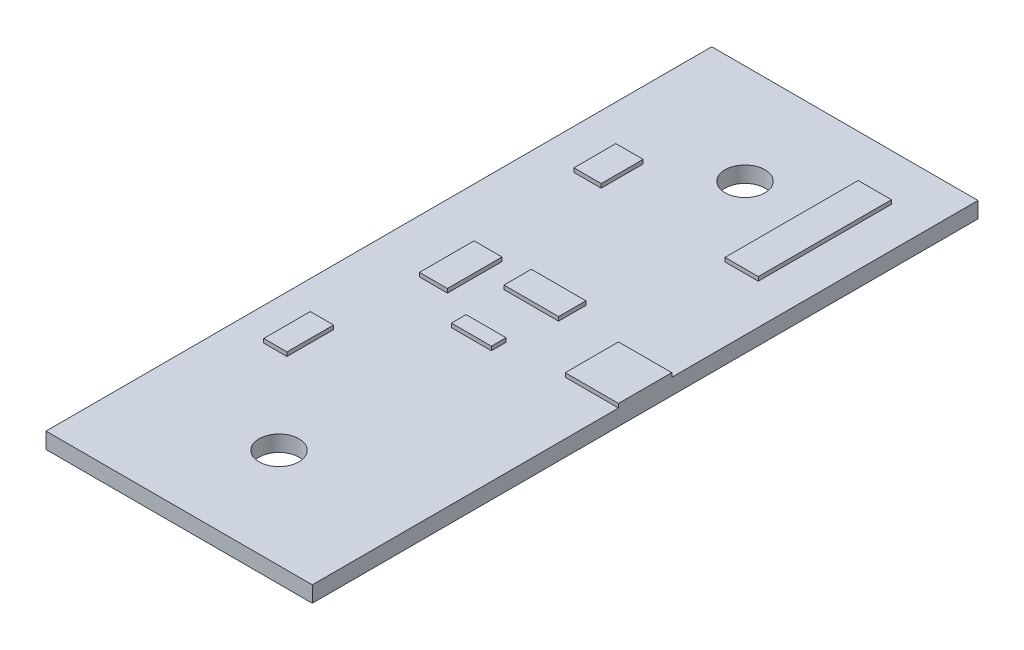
from build123d import *

# Parameters (mm, degrees)
SKETCH1_W           = 20
SKETCH1_H           = 50
BOSS_EXTRUDE1_DEPTH = 1.2
SKETCH2_R           = 1.5
CUT_EXTRUDE1_DEPTH  = 27.9525509
SKETCH3_W           = 2.5
SKETCH3_H           = 10
SKETCH3_W_2         = 2.05
SKETCH3_H_2         = 3.15
SKETCH3_W_3         = 2.1
SKETCH3_H_3         = 4.1
SKETCH3_W_4         = 4.1
SKETCH3_H_4         = 2.05
SKETCH3_W_5         = 3
SKETCH3_H_5         = 1.1
SKETCH3_W_6         = 4
SKETCH3_H_6         = 4
SKETCH3_W_7         = 1.75
SKETCH3_H_7         = 3.5
BOSS_EXTRUDE2_DEPTH = 1.5


with BuildPart() as part:
    # Sketch1 → Boss-Extrude1 (new body)
    with BuildSketch(Plane(origin=(0, 0, 0), x_dir=(1, 0, 0), z_dir=(0, 1, 0))):
        Rectangle(SKETCH1_W, SKETCH1_H)
    extrude(amount=BOSS_EXTRUDE1_DEPTH)

    # Sketch2 → Cut-Extrude1 (cut, through all)
    with BuildSketch(Plane.XZ):
        with Locations(Location((0, 17.5, 0), (0, 0, 270))):
            Circle(SKETCH2_R)
        with Locations(Location((0, -17.5, 0), (0, 0, 90))):
            Circle(SKETCH2_R)
    extrude(amount=-CUT_EXTRUDE1_DEPTH, mode=Mode.SUBTRACT)

    # Sketch3 → Boss-Extrude2 (add)
    with BuildSketch(Plane.XZ):
        with Locations((5.75, -16.5)):
            Rectangle(SKETCH3_W, SKETCH3_H)
        with Locations((-5.975, -13.225)):
            Rectangle(SKETCH3_W_2, SKETCH3_H_2)
        with Locations((-4.95, -1.1)):
            Rectangle(SKETCH3_W_3, SKETCH3_H_3)
        with Locations((0.05, -2.425)):
            Rectangle(SKETCH3_W_4, SKETCH3_H_4)
        with Locations((0, 2.5)):
            Rectangle(SKETCH3_W_5, SKETCH3_H_5)
        with Locations((8, 0)):
            Rectangle(SKETCH3_W_6, SKETCH3_H_6)
        with Locations((-6.675, 9.35)):
            Rectangle(SKETCH3_W_7, SKETCH3_H_7)
    extrude(amount=-BOSS_EXTRUDE2_DEPTH)


solid = part.part
